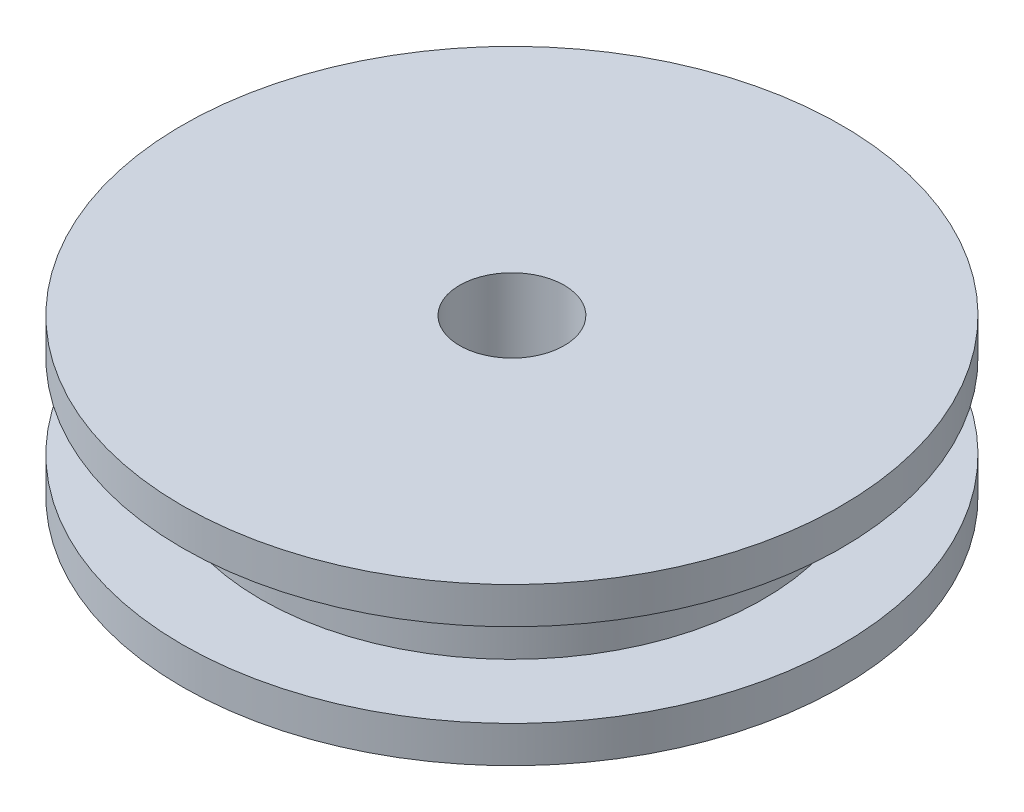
from build123d import *

# Parameters (mm, degrees)
ESBO_O1_R                = 6.3
RESSALTO_EXTRUS_O1_DEPTH = 0.7
ESBO_O10_R               = 4.8
RESSALTO_EXTRUS_O4_DEPTH = 1.6
ESBO_O11_R               = 6.3
RESSALTO_EXTRUS_O5_DEPTH = 0.7
CORTE_EXTRUS_O1_REACH    = 11.401
ESBO_O12_R               = 1


with BuildPart() as part:
    # Esbo_o1 → Ressalto-extrus_o1 (new body)
    with BuildSketch(Plane(origin=(0, 0, 0), x_dir=(1, 0, 0), z_dir=(0, 1, 0))):
        with Locations(Location((0, 0, 0), (0, 0, 270))):
            Circle(ESBO_O1_R)
    extrude(amount=RESSALTO_EXTRUS_O1_DEPTH)

    # Esbo_o10 → Ressalto-extrus_o4 (add)
    with BuildSketch(Plane(origin=(0, 0.7, 0), x_dir=(1, 0, 0), z_dir=(0, 1, 0))):
        with Locations(Location((0, 0, 0), (0, 0, 270))):
            Circle(ESBO_O10_R)
    extrude(amount=RESSALTO_EXTRUS_O4_DEPTH)

    # Esbo_o11 → Ressalto-extrus_o5 (add)
    with BuildSketch(Plane(origin=(0, 2.3, 0), x_dir=(1, 0, 0), z_dir=(0, 1, 0))):
        with Locations(Location((0, 0, 0), (0, 0, 270))):
            Circle(ESBO_O11_R)
    extrude(amount=RESSALTO_EXTRUS_O5_DEPTH)

    # Esbo_o12 → Corte-extrus_o1 (cut, up to next)
    with BuildSketch(Plane.XZ, mode=Mode.PRIVATE) as corte_extrus_o1_sk1:
        with Locations(Location((0, 0, 0), (0, 0, 270))):
            Circle(ESBO_O12_R)
    corte_extrus_o1_tool1 = extrude(corte_extrus_o1_sk1.sketch, amount=-CORTE_EXTRUS_O1_REACH, mode=Mode.PRIVATE) & part.part
    add(corte_extrus_o1_tool1.solids().sort_by_distance((0, 0, 0))[0], mode=Mode.SUBTRACT)


solid = part.part
